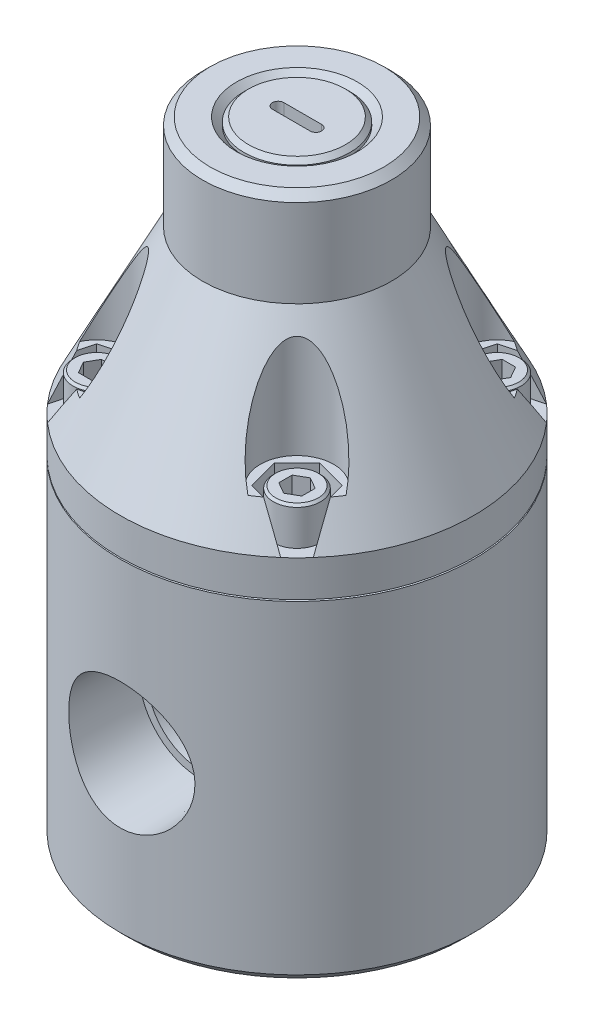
from build123d import *

# Parameters (mm, degrees)
SKETCH1_R         = 29.718
EXTRUDE1_DEPTH    = 105.41
SKETCH3_R         = 10.16
EXTRUDE2_DEPTH    = 1.27
EXTRUDE2_DRAFT    = -45
CIRPATTERN1_COUNT = 2
CHAMFER1_SIZE     = 1.27
CHAMFER2_SIZE     = 1.524
EXTRUDE3_REACH    = 115.479
SKETCH6_R         = 8.89
CHAMFER3_SIZE     = 0.762
EXTRUDE4_DEPTH    = 4.7498
SKETCH8_R         = 6.1722
EXTRUDE5_DEPTH    = 21.0058
CIRPATTERN2_COUNT = 4
EXTRUDE6_DEPTH    = 6.35
CIRPATTERN3_COUNT = 4
SKETCH10_R        = 3.9624
EXTRUDE7_DEPTH    = 6.35
EXTRUDE8_DEPTH    = 3.175
CIRPATTERN4_COUNT = 4
CHAMFER5_SIZE     = 0.381


with BuildPart() as part:
    # Sketch1 → Extrude1 (new body)
    with BuildSketch(Plane(origin=(0, 0, 0), x_dir=(1, 0, 0), z_dir=(0, 1, 0))):
        with Locations(Location((0, 0, 0), (0, 0, 270))):
            Circle(SKETCH1_R)
    extrude(amount=EXTRUDE1_DEPTH)

    # Sketch2 → Cut-Revolve1 (revolve, cut)
    with BuildSketch(Plane.XY, mode=Mode.PRIVATE) as cut_revolve1_sk:
        Polygon((-29.718, 55.88), (-20.625466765, 55.88), (-20.625466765, 56.134), (-29.718, 56.134), (-29.718, 62.23), (-15.875, 89.408), (-15.875, 105.41), (-21.125189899, 108.084162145), (-34.308703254, 108.084162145), (-34.308703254, 59.099585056), align=None)
    revolve(cut_revolve1_sk.sketch.rotate(Axis((0, 0, 0), (0, 1, 0)), 270), axis=Axis((0, 0, 0), (0, 1, 0)), mode=Mode.SUBTRACT)


with BuildPart() as extrude2_tool:
    # Sketch3 → Extrude2 (with draft: the straight prism first)
    with BuildSketch(Plane(origin=(0, 105.41, 0), x_dir=(-1, 0, 0), z_dir=(0, 1, 0))):
        Circle(SKETCH3_R)
    extrude(amount=-EXTRUDE2_DEPTH)
    # Extrude2: the draft: its side faces are tilted about the plane it starts from
    extrude2_sides = [extrude2_tool.faces().sort_by_distance(p)[0] for p in [
        (10.16, 104.775, 0),
    ]]
    draft(extrude2_sides, Plane(origin=(0, 105.41, 0), x_dir=(-1, 0, 0), z_dir=(0, 1, 0)), EXTRUDE2_DRAFT)


with BuildPart() as part_1:
    add(part.part)

    # Extrude2: cut by extrude2_tool
    add(extrude2_tool.part, mode=Mode.SUBTRACT)

    # Sketch5 → 1_2 NPT Tapped Hole1 (revolve, cut)
    with BuildSketch(Plane(origin=(0, 27.432, 29.718), x_dir=(0, -1, 0), z_dir=(1, 0, 0))):
        Polygon((0, 0), (0, 20.208140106), (8.9281, 16.51), (8.9281, 13.462), (10.261665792, 13.462), (10.6647361, 0), align=None)
    f_1_2_npt_tapped_hole1 = revolve(axis=Axis((0, 27.432, 36.068), (0, 0, -1)), mode=Mode.SUBTRACT)

    # CirPattern1: 1_2 NPT Tapped Hole1 ×2 about axis
    cirpattern1_axis = Axis((0, 105.41, 0), (0, -1, 0))
    for i in range(1, CIRPATTERN1_COUNT):
        add(f_1_2_npt_tapped_hole1.rotate(cirpattern1_axis, i * 360 / CIRPATTERN1_COUNT), mode=Mode.SUBTRACT)

    # Chamfer1
    chamfer1_edges = [part_1.edges().sort_by_distance(p)[0] for p in [
        (0, 105.41, 15.875),
    ]]
    chamfer(chamfer1_edges, length=CHAMFER1_SIZE)

    # Chamfer2
    chamfer2_edges = [part_1.edges().sort_by_distance(p)[0] for p in [
        (0, 0, -29.718),
    ]]
    chamfer(chamfer2_edges, length=CHAMFER2_SIZE)

    # Extrude3: up to this cone (the profile starts inside it)
    extrude3_end = Plane(origin=(0, 105.41, 0), z_dir=(0, 1, 0)).offset(-10.159999) * Cone(1e-06, 136.299, 136.298999, align=(Align.CENTER, Align.CENTER, Align.MIN), mode=Mode.PRIVATE)
    # Sketch6 → Extrude3 (add, up to the surface)
    with BuildSketch(Plane(origin=(0, 105.41, 0), x_dir=(-1, 0, 0), z_dir=(0, 1, 0)), mode=Mode.PRIVATE) as extrude3_sk1:
        with Locations(Location((0, 0, 0), (0, 0, 90))):
            Circle(SKETCH6_R)
    extrude3_tool1 = extrude(extrude3_sk1.sketch, amount=-EXTRUDE3_REACH, mode=Mode.PRIVATE) & extrude3_end
    add(extrude3_tool1.solids().sort_by_distance((0, 105.41, 0))[0])

    # Chamfer3
    chamfer3_edges = [part_1.edges().sort_by_distance(p)[0] for p in [
        (0, 105.41, -8.89),
    ]]
    chamfer(chamfer3_edges, length=CHAMFER3_SIZE)

    # Sketch7 → Extrude4 (cut)
    with BuildSketch(Plane(origin=(0, 105.41, 0), x_dir=(-1, 0, 0), z_dir=(0, 1, 0))):
        with BuildLine():
            Line((-3.175, 0.9652), (3.175, 0.9652))
            ThreePointArc((3.175, 0.9652), (4.1402, 0), (3.175, -0.9652))
            Line((3.175, -0.9652), (-3.175, -0.9652))
            ThreePointArc((-3.175, -0.9652), (-4.1402, 0), (-3.175, 0.9652))
        make_face()
    extrude(amount=-EXTRUDE4_DEPTH, mode=Mode.SUBTRACT)

    # Sketch8 → Extrude5 (cut)
    with BuildSketch(Plane(origin=(0, 68.58, 0), x_dir=(-1, 0, 0), z_dir=(0, 1, 0))):
        with Locations((-16.837980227, -16.837980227)):
            Circle(SKETCH8_R)
    extrude5 = extrude(amount=EXTRUDE5_DEPTH, mode=Mode.SUBTRACT)

    # CirPattern2: Extrude5 ×4 about axis
    cirpattern2_axis = Axis((0, 0, 0), (0, 1, 0))
    for i in range(1, CIRPATTERN2_COUNT):
        add(extrude5.rotate(cirpattern2_axis, i * 360 / CIRPATTERN2_COUNT), mode=Mode.SUBTRACT)

    # Sketch9 → Extrude6 (cut)
    with BuildSketch(Plane(origin=(0, 68.58, 0), x_dir=(-1, 0, 0), z_dir=(0, 1, 0))):
        Polygon((-20.633219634, -13.04274082), (-23.297950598, -23.297950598), (-13.04274082, -20.633219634), (-11.653586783, -15.44882619), (-15.44882619, -11.653586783), align=None)
    extrude6 = extrude(amount=-EXTRUDE6_DEPTH, mode=Mode.SUBTRACT)

    # CirPattern3: Extrude6 ×4 about axis
    cirpattern3_axis = Axis((0, 0, 0), (0, 1, 0))
    for i in range(1, CIRPATTERN3_COUNT):
        add(extrude6.rotate(cirpattern3_axis, i * 360 / CIRPATTERN3_COUNT), mode=Mode.SUBTRACT)

    # Sketch10 → Extrude7 (add)
    with BuildSketch(Plane(origin=(0, 68.58, 0), x_dir=(-1, 0, 0), z_dir=(0, 1, 0))):
        with Locations(Location((-16.837980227, -16.837980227, 0), (0, 0, 90))):
            Circle(SKETCH10_R)
    extrude7 = extrude(amount=-EXTRUDE7_DEPTH)

    # Sketch11 → Extrude8 (cut)
    with BuildSketch(Plane(origin=(0, 68.58, 0), x_dir=(-1, 0, 0), z_dir=(0, 1, 0))):
        Polygon((-19.075541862, -16.837980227), (-17.956761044, -18.775765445), (-15.71919941, -18.775765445), (-14.600418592, -16.837980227), (-15.71919941, -14.900195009), (-17.956761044, -14.900195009), align=None)
    extrude8 = extrude(amount=-EXTRUDE8_DEPTH, mode=Mode.SUBTRACT)

    # CirPattern4: Extrude7, Extrude8 ×4 about axis
    cirpattern4_axis = Axis((0, 0, 0), (0, 1, 0))
    add([extrude7.rotate(cirpattern4_axis, i * 360 / CIRPATTERN4_COUNT) for i in range(1, CIRPATTERN4_COUNT)])
    add([extrude8.rotate(cirpattern4_axis, i * 360 / CIRPATTERN4_COUNT) for i in range(1, CIRPATTERN4_COUNT)], mode=Mode.SUBTRACT)

    # Chamfer5
    chamfer5_edges = [part_1.edges().sort_by_distance(p)[0] for p in [
        (16.837980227, 68.58, -20.800380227),
        (20.800380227, 68.58, 16.837980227),
        (-16.837980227, 68.58, 20.800380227),
        (-20.800380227, 68.58, -16.837980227),
    ]]
    chamfer(chamfer5_edges, length=CHAMFER5_SIZE)

    # Sketch13 → 1_2 NPT Tapped Hole2 (revolve, cut)
    with BuildSketch(Plane(origin=(0, 0, 0), x_dir=(0, 0, -1), z_dir=(1, 0, 0))):
        Polygon((0, 0), (0, 20.208140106), (8.9281, 16.51), (8.9281, 13.462), (10.261665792, 13.462), (10.6647361, 0), align=None)
    revolve(axis=Axis((0, -6.35, 0), (0, 1, 0)), mode=Mode.SUBTRACT)


solid = part_1.part
